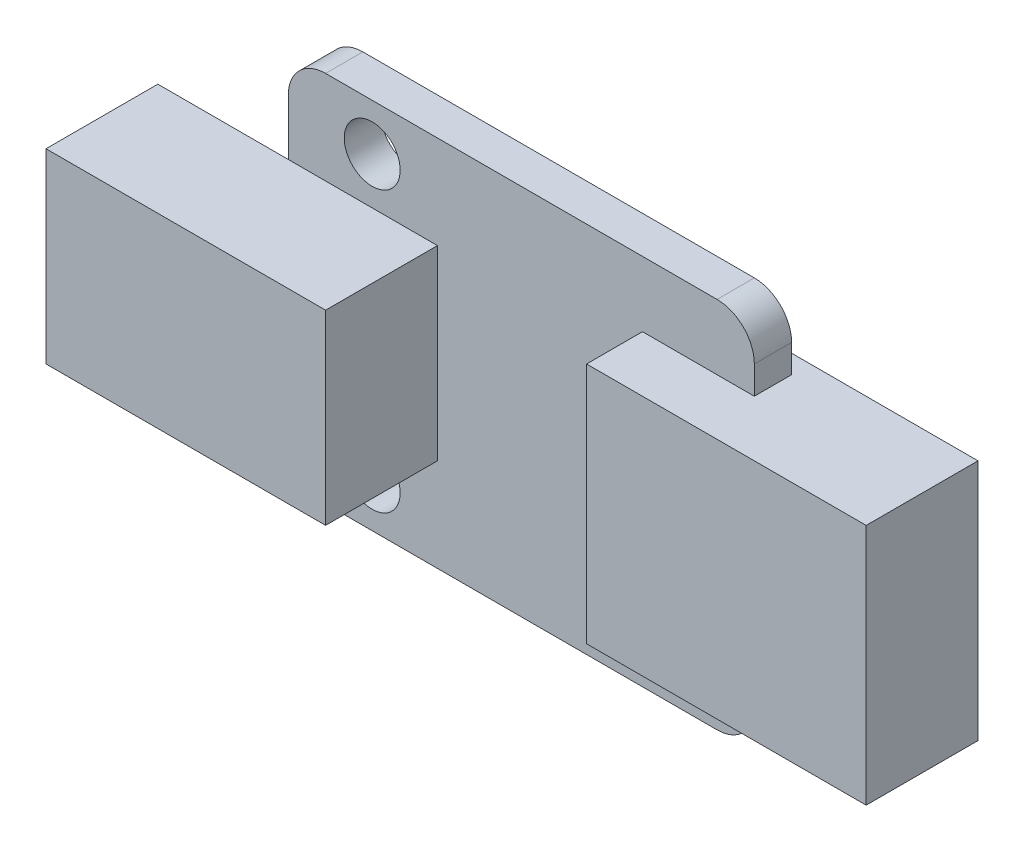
from build123d import *

# Parameters (mm, degrees)
SKETCH3_W           = 25
SKETCH3_H           = 20
SKETCH3_R           = 1.5
BOSS_EXTRUDE1_DEPTH = 2
SKETCH4_W           = 15
SKETCH4_H           = 13
BOSS_EXTRUDE2_DEPTH = 3
SKETCH5_W           = 15
SKETCH5_H           = 10
BOSS_EXTRUDE3_DEPTH = 6
FILLET1_R           = 2


with BuildPart() as part:
    # Sketch3 → Boss-Extrude1 (new body)
    with BuildSketch(Plane.XY):
        Rectangle(SKETCH3_W, SKETCH3_H)
        with Locations((-8, 7.5)):
            Circle(SKETCH3_R, mode=Mode.SUBTRACT)
        with Locations((-8, -7.5)):
            Circle(SKETCH3_R, mode=Mode.SUBTRACT)
    extrude(amount=BOSS_EXTRUDE1_DEPTH)

    # Sketch4 → Boss-Extrude2 (add, symmetric)
    with BuildSketch(Plane.XY.offset(2)):
        with Locations((14, 0)):
            Rectangle(SKETCH4_W, SKETCH4_H)
    extrude(amount=BOSS_EXTRUDE2_DEPTH, both=True)

    # Sketch5 → Boss-Extrude3 (add)
    with BuildSketch(Plane.XY.offset(2)):
        with Locations((-12, 0)):
            Rectangle(SKETCH5_W, SKETCH5_H)
    extrude(amount=BOSS_EXTRUDE3_DEPTH)

    # Fillet1
    fillet1_edges = [part.edges().sort_by_distance(p)[0] for p in [
        (12.5, -10, 1),
        (-12.5, -10, 1),
        (-12.5, 10, 1),
        (12.5, 10, 1),
    ]]
    fillet(fillet1_edges, radius=FILLET1_R)


solid = part.part
